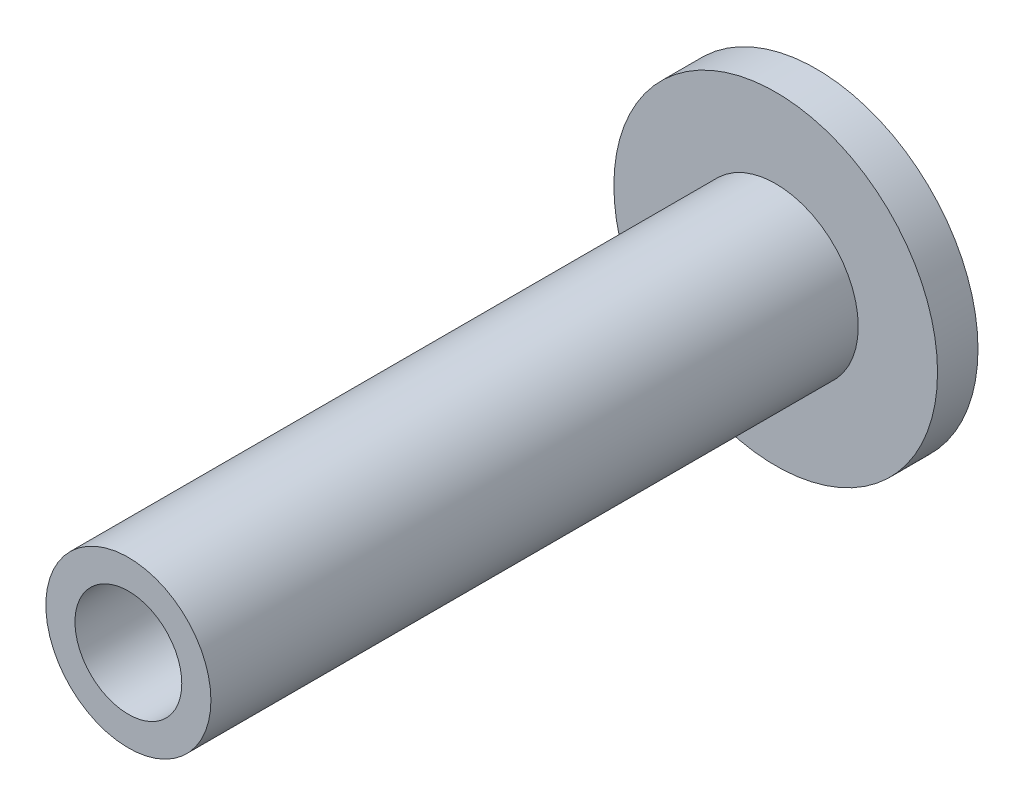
ISO-10303-21;
HEADER;
FILE_DESCRIPTION(('STEP AP214'),'2;1');
FILE_NAME('part.step','',(''),(''),'','','');
FILE_SCHEMA(('AUTOMOTIVE_DESIGN { 1 0 10303 214 1 1 1 1 }'));
ENDSEC;
DATA;
#1=APPLICATION_CONTEXT('core data for automotive mechanical design processes');
#2=APPLICATION_PROTOCOL_DEFINITION('international standard','automotive_design',2000,#1);
#3=PRODUCT_CONTEXT('',#1,'mechanical');
#4=PRODUCT('Part','Part','',(#3));
#5=PRODUCT_RELATED_PRODUCT_CATEGORY('part','',(#4));
#6=PRODUCT_DEFINITION_FORMATION('','',#4);
#7=PRODUCT_DEFINITION_CONTEXT('part definition',#1,'design');
#8=PRODUCT_DEFINITION('design','',#6,#7);
#9=PRODUCT_DEFINITION_SHAPE('','',#8);
#10=(LENGTH_UNIT() NAMED_UNIT(*) SI_UNIT(.MILLI.,.METRE.));
#11=(NAMED_UNIT(*) PLANE_ANGLE_UNIT() SI_UNIT($,.RADIAN.));
#12=(NAMED_UNIT(*) SI_UNIT($,.STERADIAN.) SOLID_ANGLE_UNIT());
#13=UNCERTAINTY_MEASURE_WITH_UNIT(LENGTH_MEASURE(1.E-05),#10,'distance_accuracy_value','');
#14=(GEOMETRIC_REPRESENTATION_CONTEXT(3) GLOBAL_UNCERTAINTY_ASSIGNED_CONTEXT((#13)) GLOBAL_UNIT_ASSIGNED_CONTEXT((#10,
#11,#12)) REPRESENTATION_CONTEXT('',''));
#15=CARTESIAN_POINT('',(0.,0.,0.));
#16=DIRECTION('',(0.,0.,1.));
#17=DIRECTION('',(1.,0.,0.));
#18=AXIS2_PLACEMENT_3D('',#15,#16,#17);
#19=CARTESIAN_POINT('',(-38.1,-101.6,0.));
#20=DIRECTION('',(0.,0.,1.));
#21=DIRECTION('',(1.,0.,0.));
#22=AXIS2_PLACEMENT_3D('',#19,#20,#21);
#23=PLANE('',#22);
#24=CARTESIAN_POINT('',(-38.1,-101.6,0.));
#25=DIRECTION('',(0.,0.,1.));
#26=DIRECTION('',(1.,0.,0.));
#27=AXIS2_PLACEMENT_3D('',#24,#25,#26);
#28=CIRCLE('',#27,6.34999999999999);
#29=CARTESIAN_POINT('',(-31.75,-101.6,0.));
#30=VERTEX_POINT('',#29);
#31=EDGE_CURVE('E36',#30,#30,#28,.T.);
#32=ORIENTED_EDGE('',*,*,#31,.T.);
#33=EDGE_LOOP('',(#32));
#34=FACE_BOUND('',#33,.T.);
#35=CARTESIAN_POINT('',(-38.1,-101.6,0.));
#36=DIRECTION('',(0.,0.,1.));
#37=DIRECTION('',(1.,0.,0.));
#38=AXIS2_PLACEMENT_3D('',#35,#36,#37);
#39=CIRCLE('',#38,3.2385);
#40=CARTESIAN_POINT('',(-34.8615,-101.6,0.));
#41=VERTEX_POINT('',#40);
#42=EDGE_CURVE('E44',#41,#41,#39,.T.);
#43=ORIENTED_EDGE('',*,*,#42,.F.);
#44=EDGE_LOOP('',(#43));
#45=FACE_BOUND('',#44,.T.);
#46=ADVANCED_FACE('F29',(#34,#45),#23,.T.);
#47=CARTESIAN_POINT('',(-38.1,-101.6,-19.5480122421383));
#48=DIRECTION('',(0.,0.,1.));
#49=DIRECTION('',(1.,0.,0.));
#50=AXIS2_PLACEMENT_3D('',#47,#48,#49);
#51=CYLINDRICAL_SURFACE('',#50,6.34999999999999);
#52=CARTESIAN_POINT('',(-38.1,-101.6,-1.58750000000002));
#53=DIRECTION('',(0.,0.,1.));
#54=DIRECTION('',(1.,0.,0.));
#55=AXIS2_PLACEMENT_3D('',#52,#53,#54);
#56=CIRCLE('',#55,6.34999999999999);
#57=CARTESIAN_POINT('',(-31.75,-101.6,-1.58750000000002));
#58=VERTEX_POINT('',#57);
#59=EDGE_CURVE('E10',#58,#58,#56,.F.);
#60=ORIENTED_EDGE('',*,*,#59,.F.);
#61=EDGE_LOOP('',(#60));
#62=FACE_BOUND('',#61,.T.);
#63=ORIENTED_EDGE('',*,*,#31,.F.);
#64=EDGE_LOOP('',(#63));
#65=FACE_BOUND('',#64,.T.);
#66=ADVANCED_FACE('F31',(#62,#65),#51,.T.);
#67=CARTESIAN_POINT('',(76.1999999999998,-860.567570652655,-1.58750000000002));
#68=DIRECTION('',(0.,0.,1.));
#69=DIRECTION('',(0.,1.,0.));
#70=AXIS2_PLACEMENT_3D('',#67,#68,#69);
#71=PLANE('',#70);
#72=CARTESIAN_POINT('',(-38.1,-101.6,-1.58750000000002));
#73=DIRECTION('',(0.,0.,1.));
#74=DIRECTION('',(1.,0.,0.));
#75=AXIS2_PLACEMENT_3D('',#72,#73,#74);
#76=CIRCLE('',#75,2.0955);
#77=CARTESIAN_POINT('',(-36.0045,-101.6,-1.58750000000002));
#78=VERTEX_POINT('',#77);
#79=EDGE_CURVE('E48',#78,#78,#76,.T.);
#80=ORIENTED_EDGE('',*,*,#79,.T.);
#81=EDGE_LOOP('',(#80));
#82=FACE_BOUND('',#81,.T.);
#83=ORIENTED_EDGE('',*,*,#59,.T.);
#84=EDGE_LOOP('',(#83));
#85=FACE_BOUND('',#84,.T.);
#86=ADVANCED_FACE('F56',(#82,#85),#71,.F.);
#87=CARTESIAN_POINT('',(-38.1,-101.6,25.4));
#88=DIRECTION('',(0.,0.,-1.));
#89=DIRECTION('',(-1.,0.,0.));
#90=AXIS2_PLACEMENT_3D('',#87,#88,#89);
#91=CYLINDRICAL_SURFACE('',#90,3.2385);
#92=CARTESIAN_POINT('',(-38.1,-101.6,25.4));
#93=DIRECTION('',(0.,0.,1.));
#94=DIRECTION('',(1.,0.,0.));
#95=AXIS2_PLACEMENT_3D('',#92,#93,#94);
#96=CIRCLE('',#95,3.2385);
#97=CARTESIAN_POINT('',(-34.8615,-101.6,25.4));
#98=VERTEX_POINT('',#97);
#99=EDGE_CURVE('E40',#98,#98,#96,.T.);
#100=ORIENTED_EDGE('',*,*,#99,.F.);
#101=EDGE_LOOP('',(#100));
#102=FACE_BOUND('',#101,.T.);
#103=ORIENTED_EDGE('',*,*,#42,.T.);
#104=EDGE_LOOP('',(#103));
#105=FACE_BOUND('',#104,.T.);
#106=ADVANCED_FACE('F67',(#102,#105),#91,.T.);
#107=CARTESIAN_POINT('',(-38.1,-101.6,25.4));
#108=DIRECTION('',(0.,0.,1.));
#109=DIRECTION('',(1.,0.,0.));
#110=AXIS2_PLACEMENT_3D('',#107,#108,#109);
#111=PLANE('',#110);
#112=CARTESIAN_POINT('',(-38.1,-101.6,25.4));
#113=DIRECTION('',(0.,0.,1.));
#114=DIRECTION('',(1.,0.,0.));
#115=AXIS2_PLACEMENT_3D('',#112,#113,#114);
#116=CIRCLE('',#115,2.0955);
#117=CARTESIAN_POINT('',(-36.0045,-101.6,25.4));
#118=VERTEX_POINT('',#117);
#119=EDGE_CURVE('E50',#118,#118,#116,.T.);
#120=ORIENTED_EDGE('',*,*,#119,.F.);
#121=EDGE_LOOP('',(#120));
#122=FACE_BOUND('',#121,.T.);
#123=ORIENTED_EDGE('',*,*,#99,.T.);
#124=EDGE_LOOP('',(#123));
#125=FACE_BOUND('',#124,.T.);
#126=ADVANCED_FACE('F61',(#122,#125),#111,.T.);
#127=CARTESIAN_POINT('',(-38.1,-101.6,-1.58750000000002));
#128=DIRECTION('',(0.,0.,1.));
#129=DIRECTION('',(1.,0.,0.));
#130=AXIS2_PLACEMENT_3D('',#127,#128,#129);
#131=CYLINDRICAL_SURFACE('',#130,2.0955);
#132=ORIENTED_EDGE('',*,*,#79,.F.);
#133=EDGE_LOOP('',(#132));
#134=FACE_BOUND('',#133,.T.);
#135=ORIENTED_EDGE('',*,*,#119,.T.);
#136=EDGE_LOOP('',(#135));
#137=FACE_BOUND('',#136,.T.);
#138=ADVANCED_FACE('F58',(#134,#137),#131,.F.);
#139=CLOSED_SHELL('',(#46,#66,#86,#106,#126,#138));
#140=MANIFOLD_SOLID_BREP('B2',#139);
#141=ADVANCED_BREP_SHAPE_REPRESENTATION('',(#18,#140),#14);
#142=SHAPE_DEFINITION_REPRESENTATION(#9,#141);
ENDSEC;
END-ISO-10303-21;
